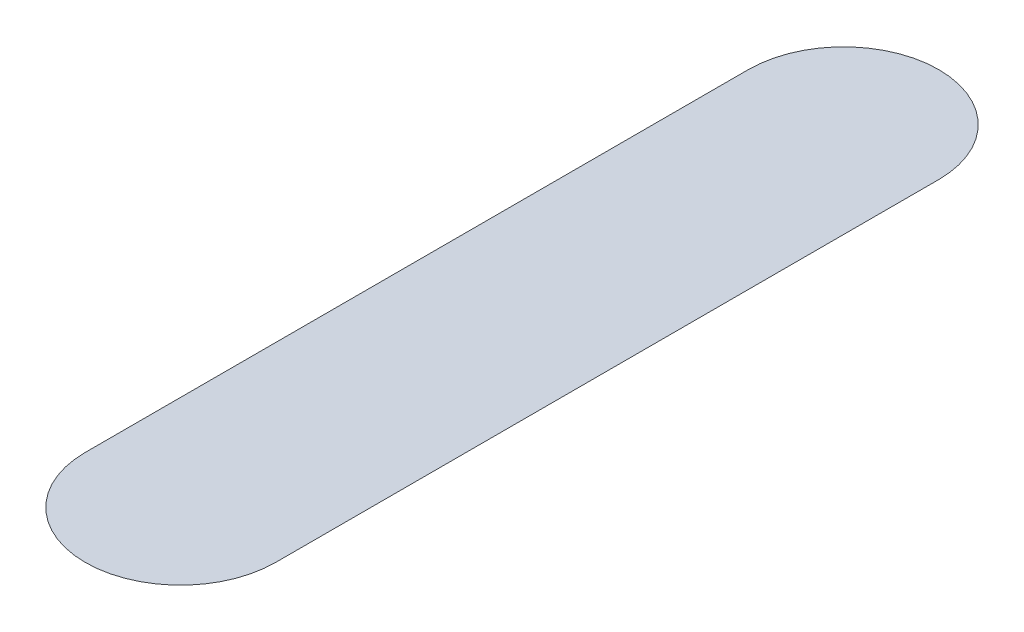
ISO-10303-21;
HEADER;
FILE_DESCRIPTION(('STEP AP214'),'2;1');
FILE_NAME('part.step','',(''),(''),'','','');
FILE_SCHEMA(('AUTOMOTIVE_DESIGN { 1 0 10303 214 1 1 1 1 }'));
ENDSEC;
DATA;
#1=APPLICATION_CONTEXT('core data for automotive mechanical design processes');
#2=APPLICATION_PROTOCOL_DEFINITION('international standard','automotive_design',2000,#1);
#3=PRODUCT_CONTEXT('',#1,'mechanical');
#4=PRODUCT('Part','Part','',(#3));
#5=PRODUCT_RELATED_PRODUCT_CATEGORY('part','',(#4));
#6=PRODUCT_DEFINITION_FORMATION('','',#4);
#7=PRODUCT_DEFINITION_CONTEXT('part definition',#1,'design');
#8=PRODUCT_DEFINITION('design','',#6,#7);
#9=PRODUCT_DEFINITION_SHAPE('','',#8);
#10=(LENGTH_UNIT() NAMED_UNIT(*) SI_UNIT(.MILLI.,.METRE.));
#11=(NAMED_UNIT(*) PLANE_ANGLE_UNIT() SI_UNIT($,.RADIAN.));
#12=(NAMED_UNIT(*) SI_UNIT($,.STERADIAN.) SOLID_ANGLE_UNIT());
#13=UNCERTAINTY_MEASURE_WITH_UNIT(LENGTH_MEASURE(1.E-05),#10,'distance_accuracy_value','');
#14=(GEOMETRIC_REPRESENTATION_CONTEXT(3) GLOBAL_UNCERTAINTY_ASSIGNED_CONTEXT((#13)) GLOBAL_UNIT_ASSIGNED_CONTEXT((#10,
#11,#12)) REPRESENTATION_CONTEXT('',''));
#15=CARTESIAN_POINT('',(0.,0.,0.));
#16=DIRECTION('',(0.,0.,1.));
#17=DIRECTION('',(1.,0.,0.));
#18=AXIS2_PLACEMENT_3D('',#15,#16,#17);
#19=CARTESIAN_POINT('',(0.,10.5,60.3960780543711));
#20=DIRECTION('',(0.,0.,-1.));
#21=DIRECTION('',(-1.,0.,0.));
#22=AXIS2_PLACEMENT_3D('',#19,#20,#21);
#23=CYLINDRICAL_SURFACE('',#22,14.5);
#24=CARTESIAN_POINT('',(0.,10.5,-40.));
#25=DIRECTION('',(0.,0.,1.));
#26=DIRECTION('',(1.,0.,0.));
#27=AXIS2_PLACEMENT_3D('',#24,#25,#26);
#28=CIRCLE('',#27,14.5);
#29=CARTESIAN_POINT('',(-9.00499009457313,-0.864864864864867,-40.));
#30=VERTEX_POINT('',#29);
#31=CARTESIAN_POINT('',(9.00499009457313,-0.864864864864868,-40.));
#32=VERTEX_POINT('',#31);
#33=EDGE_CURVE('E110',#30,#32,#28,.T.);
#34=ORIENTED_EDGE('',*,*,#33,.T.);
#35=DIRECTION('',(0.,0.,-1.));
#36=VECTOR('',#35,1.);
#37=CARTESIAN_POINT('',(9.00499009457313,-0.864864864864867,60.3960780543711));
#38=LINE('',#37,#36);
#39=CARTESIAN_POINT('',(9.00499009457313,-0.864864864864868,40.));
#40=VERTEX_POINT('',#39);
#41=EDGE_CURVE('E88',#32,#40,#38,.F.);
#42=ORIENTED_EDGE('',*,*,#41,.T.);
#43=CARTESIAN_POINT('',(0.,10.5,40.));
#44=DIRECTION('',(0.,0.,1.));
#45=DIRECTION('',(1.,0.,0.));
#46=AXIS2_PLACEMENT_3D('',#43,#44,#45);
#47=CIRCLE('',#46,14.5);
#48=CARTESIAN_POINT('',(-9.00499009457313,-0.864864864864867,40.));
#49=VERTEX_POINT('',#48);
#50=EDGE_CURVE('E99',#49,#40,#47,.T.);
#51=ORIENTED_EDGE('',*,*,#50,.F.);
#52=DIRECTION('',(0.,0.,-1.));
#53=VECTOR('',#52,1.);
#54=CARTESIAN_POINT('',(-9.00499009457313,-0.864864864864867,60.3960780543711));
#55=LINE('',#54,#53);
#56=EDGE_CURVE('E52',#49,#30,#55,.T.);
#57=ORIENTED_EDGE('',*,*,#56,.T.);
#58=EDGE_LOOP('',(#34,#42,#51,#57));
#59=FACE_BOUND('',#58,.T.);
#60=ADVANCED_FACE('F34',(#59),#23,.T.);
#61=CARTESIAN_POINT('',(0.,10.5,40.));
#62=DIRECTION('',(0.,-1.,0.));
#63=DIRECTION('',(1.,0.,0.));
#64=AXIS2_PLACEMENT_3D('',#61,#62,#63);
#65=SPHERICAL_SURFACE('',#64,14.5);
#66=ORIENTED_EDGE('',*,*,#50,.T.);
#67=CARTESIAN_POINT('',(0.,-0.864864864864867,40.));
#68=DIRECTION('',(0.,1.,0.));
#69=DIRECTION('',(0.,0.,1.));
#70=AXIS2_PLACEMENT_3D('',#67,#68,#69);
#71=CIRCLE('',#70,9.00499009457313);
#72=EDGE_CURVE('E41',#40,#49,#71,.F.);
#73=ORIENTED_EDGE('',*,*,#72,.T.);
#74=EDGE_LOOP('',(#66,#73));
#75=FACE_BOUND('',#74,.T.);
#76=ADVANCED_FACE('F107',(#75),#65,.T.);
#77=CARTESIAN_POINT('',(0.,10.5,-40.));
#78=DIRECTION('',(0.,1.,0.));
#79=DIRECTION('',(1.,0.,0.));
#80=AXIS2_PLACEMENT_3D('',#77,#78,#79);
#81=SPHERICAL_SURFACE('',#80,14.5);
#82=ORIENTED_EDGE('',*,*,#33,.F.);
#83=CARTESIAN_POINT('',(0.,-0.864864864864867,-40.));
#84=DIRECTION('',(0.,1.,0.));
#85=DIRECTION('',(0.,0.,1.));
#86=AXIS2_PLACEMENT_3D('',#83,#84,#85);
#87=CIRCLE('',#86,9.00499009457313);
#88=EDGE_CURVE('E11',#30,#32,#87,.F.);
#89=ORIENTED_EDGE('',*,*,#88,.T.);
#90=EDGE_LOOP('',(#82,#89));
#91=FACE_BOUND('',#90,.T.);
#92=ADVANCED_FACE('F120',(#91),#81,.T.);
#93=CARTESIAN_POINT('',(-11.4891252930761,-4.,60.3960780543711));
#94=DIRECTION('',(0.,0.,-1.));
#95=DIRECTION('',(-1.,0.,0.));
#96=AXIS2_PLACEMENT_3D('',#93,#94,#95);
#97=CYLINDRICAL_SURFACE('',#96,4.);
#98=CARTESIAN_POINT('',(-11.4891252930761,-4.,-40.));
#99=DIRECTION('',(0.,0.,1.));
#100=DIRECTION('',(1.,0.,0.));
#101=AXIS2_PLACEMENT_3D('',#98,#99,#100);
#102=CIRCLE('',#101,4.);
#103=CARTESIAN_POINT('',(-11.4891252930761,0.,-40.));
#104=VERTEX_POINT('',#103);
#105=EDGE_CURVE('E95',#30,#104,#102,.T.);
#106=ORIENTED_EDGE('',*,*,#105,.F.);
#107=ORIENTED_EDGE('',*,*,#56,.F.);
#108=CARTESIAN_POINT('',(-11.4891252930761,-4.,40.));
#109=DIRECTION('',(0.,0.,-1.));
#110=DIRECTION('',(-1.,0.,0.));
#111=AXIS2_PLACEMENT_3D('',#108,#109,#110);
#112=CIRCLE('',#111,4.);
#113=CARTESIAN_POINT('',(-11.4891252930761,0.,40.));
#114=VERTEX_POINT('',#113);
#115=EDGE_CURVE('E114',#114,#49,#112,.T.);
#116=ORIENTED_EDGE('',*,*,#115,.F.);
#117=DIRECTION('',(0.,0.,-1.));
#118=VECTOR('',#117,1.);
#119=CARTESIAN_POINT('',(-11.4891252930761,0.,70.));
#120=LINE('',#119,#118);
#121=EDGE_CURVE('E96',#104,#114,#120,.F.);
#122=ORIENTED_EDGE('',*,*,#121,.F.);
#123=EDGE_LOOP('',(#106,#107,#116,#122));
#124=FACE_BOUND('',#123,.T.);
#125=ADVANCED_FACE('F113',(#124),#97,.F.);
#126=CARTESIAN_POINT('',(0.,-4.,40.));
#127=DIRECTION('',(0.,-1.,0.));
#128=DIRECTION('',(0.,0.,-1.));
#129=AXIS2_PLACEMENT_3D('',#126,#127,#128);
#130=TOROIDAL_SURFACE('',#129,11.4891252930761,4.);
#131=ORIENTED_EDGE('',*,*,#115,.T.);
#132=ORIENTED_EDGE('',*,*,#72,.F.);
#133=CARTESIAN_POINT('',(11.4891252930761,-4.,40.));
#134=DIRECTION('',(0.,0.,1.));
#135=DIRECTION('',(1.,0.,0.));
#136=AXIS2_PLACEMENT_3D('',#133,#134,#135);
#137=CIRCLE('',#136,4.);
#138=CARTESIAN_POINT('',(11.4891252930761,0.,40.));
#139=VERTEX_POINT('',#138);
#140=EDGE_CURVE('E90',#139,#40,#137,.T.);
#141=ORIENTED_EDGE('',*,*,#140,.F.);
#142=CARTESIAN_POINT('',(0.,0.,40.));
#143=DIRECTION('',(0.,-1.,0.));
#144=DIRECTION('',(0.,0.,-1.));
#145=AXIS2_PLACEMENT_3D('',#142,#143,#144);
#146=CIRCLE('',#145,11.4891252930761);
#147=EDGE_CURVE('E79',#114,#139,#146,.F.);
#148=ORIENTED_EDGE('',*,*,#147,.F.);
#149=EDGE_LOOP('',(#131,#132,#141,#148));
#150=FACE_BOUND('',#149,.T.);
#151=ADVANCED_FACE('F115',(#150),#130,.F.);
#152=CARTESIAN_POINT('',(0.,-4.,-40.));
#153=DIRECTION('',(0.,-1.,0.));
#154=DIRECTION('',(0.,0.,-1.));
#155=AXIS2_PLACEMENT_3D('',#152,#153,#154);
#156=TOROIDAL_SURFACE('',#155,11.4891252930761,4.);
#157=ORIENTED_EDGE('',*,*,#105,.T.);
#158=CARTESIAN_POINT('',(0.,0.,-40.));
#159=DIRECTION('',(0.,-1.,0.));
#160=DIRECTION('',(0.,0.,-1.));
#161=AXIS2_PLACEMENT_3D('',#158,#159,#160);
#162=CIRCLE('',#161,11.4891252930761);
#163=CARTESIAN_POINT('',(11.4891252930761,0.,-40.));
#164=VERTEX_POINT('',#163);
#165=EDGE_CURVE('E76',#164,#104,#162,.F.);
#166=ORIENTED_EDGE('',*,*,#165,.F.);
#167=CARTESIAN_POINT('',(11.4891252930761,-4.,-40.));
#168=DIRECTION('',(0.,0.,-1.));
#169=DIRECTION('',(-1.,0.,0.));
#170=AXIS2_PLACEMENT_3D('',#167,#168,#169);
#171=CIRCLE('',#170,4.);
#172=EDGE_CURVE('E85',#32,#164,#171,.T.);
#173=ORIENTED_EDGE('',*,*,#172,.F.);
#174=ORIENTED_EDGE('',*,*,#88,.F.);
#175=EDGE_LOOP('',(#157,#166,#173,#174));
#176=FACE_BOUND('',#175,.T.);
#177=ADVANCED_FACE('F93',(#176),#156,.F.);
#178=CARTESIAN_POINT('',(11.4891252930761,-4.,60.3960780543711));
#179=DIRECTION('',(0.,0.,-1.));
#180=DIRECTION('',(-1.,0.,0.));
#181=AXIS2_PLACEMENT_3D('',#178,#179,#180);
#182=CYLINDRICAL_SURFACE('',#181,4.);
#183=ORIENTED_EDGE('',*,*,#140,.T.);
#184=ORIENTED_EDGE('',*,*,#41,.F.);
#185=ORIENTED_EDGE('',*,*,#172,.T.);
#186=DIRECTION('',(0.,0.,-1.));
#187=VECTOR('',#186,1.);
#188=CARTESIAN_POINT('',(11.4891252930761,0.,70.));
#189=LINE('',#188,#187);
#190=EDGE_CURVE('E72',#139,#164,#189,.T.);
#191=ORIENTED_EDGE('',*,*,#190,.F.);
#192=EDGE_LOOP('',(#183,#184,#185,#191));
#193=FACE_BOUND('',#192,.T.);
#194=ADVANCED_FACE('F86',(#193),#182,.F.);
#195=CARTESIAN_POINT('',(25.,0.,-70.));
#196=DIRECTION('',(0.,-1.,0.));
#197=DIRECTION('',(0.,0.,-1.));
#198=AXIS2_PLACEMENT_3D('',#195,#196,#197);
#199=PLANE('',#198);
#200=ORIENTED_EDGE('',*,*,#121,.T.);
#201=ORIENTED_EDGE('',*,*,#147,.T.);
#202=ORIENTED_EDGE('',*,*,#190,.T.);
#203=ORIENTED_EDGE('',*,*,#165,.T.);
#204=EDGE_LOOP('',(#200,#201,#202,#203));
#205=FACE_BOUND('',#204,.T.);
#206=ADVANCED_FACE('F74',(#205),#199,.F.);
#207=CLOSED_SHELL('',(#60,#76,#92,#125,#151,#177,#194,#206));
#208=MANIFOLD_SOLID_BREP('B2',#207);
#209=ADVANCED_BREP_SHAPE_REPRESENTATION('',(#18,#208),#14);
#210=SHAPE_DEFINITION_REPRESENTATION(#9,#209);
ENDSEC;
END-ISO-10303-21;
